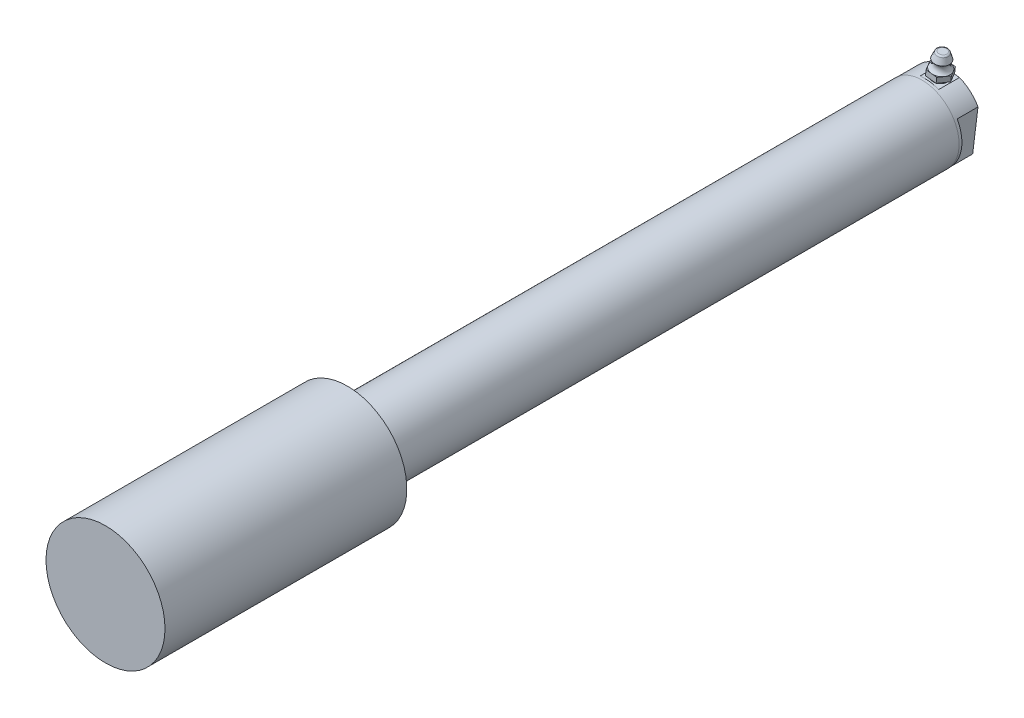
ISO-10303-21;
HEADER;
FILE_DESCRIPTION(('STEP AP214'),'2;1');
FILE_NAME('part.step','',(''),(''),'','','');
FILE_SCHEMA(('AUTOMOTIVE_DESIGN { 1 0 10303 214 1 1 1 1 }'));
ENDSEC;
DATA;
#1=APPLICATION_CONTEXT('core data for automotive mechanical design processes');
#2=APPLICATION_PROTOCOL_DEFINITION('international standard','automotive_design',2000,#1);
#3=PRODUCT_CONTEXT('',#1,'mechanical');
#4=PRODUCT('Part','Part','',(#3));
#5=PRODUCT_RELATED_PRODUCT_CATEGORY('part','',(#4));
#6=PRODUCT_DEFINITION_FORMATION('','',#4);
#7=PRODUCT_DEFINITION_CONTEXT('part definition',#1,'design');
#8=PRODUCT_DEFINITION('design','',#6,#7);
#9=PRODUCT_DEFINITION_SHAPE('','',#8);
#10=(LENGTH_UNIT() NAMED_UNIT(*) SI_UNIT(.MILLI.,.METRE.));
#11=(NAMED_UNIT(*) PLANE_ANGLE_UNIT() SI_UNIT($,.RADIAN.));
#12=(NAMED_UNIT(*) SI_UNIT($,.STERADIAN.) SOLID_ANGLE_UNIT());
#13=UNCERTAINTY_MEASURE_WITH_UNIT(LENGTH_MEASURE(1.E-05),#10,'distance_accuracy_value','');
#14=(GEOMETRIC_REPRESENTATION_CONTEXT(3) GLOBAL_UNCERTAINTY_ASSIGNED_CONTEXT((#13)) GLOBAL_UNIT_ASSIGNED_CONTEXT((#10,
#11,#12)) REPRESENTATION_CONTEXT('',''));
#15=CARTESIAN_POINT('',(0.,0.,0.));
#16=DIRECTION('',(0.,0.,1.));
#17=DIRECTION('',(1.,0.,0.));
#18=AXIS2_PLACEMENT_3D('',#15,#16,#17);
#19=CARTESIAN_POINT('',(1.40263997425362,11.4235858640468,4.445));
#20=DIRECTION('',(0.121869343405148,0.992546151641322,0.));
#21=DIRECTION('',(0.,0.,1.));
#22=AXIS2_PLACEMENT_3D('',#19,#20,#21);
#23=CONICAL_SURFACE('',#22,3.048,0.0447462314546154);
#24=CARTESIAN_POINT('',(1.92113309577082,15.6463734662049,4.445));
#25=DIRECTION('',(-0.121869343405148,-0.992546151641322,0.));
#26=DIRECTION('',(0.,0.,-1.));
#27=AXIS2_PLACEMENT_3D('',#24,#25,#26);
#28=CIRCLE('',#27,3.2385);
#29=CARTESIAN_POINT('',(1.92113309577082,15.6463734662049,1.2065));
#30=VERTEX_POINT('',#29);
#31=EDGE_CURVE('E363',#30,#30,#28,.T.);
#32=ORIENTED_EDGE('',*,*,#31,.T.);
#33=EDGE_LOOP('',(#32));
#34=FACE_BOUND('',#33,.T.);
#35=CARTESIAN_POINT('',(1.85728879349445,15.1264033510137,4.445));
#36=DIRECTION('',(-0.121869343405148,-0.992546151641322,0.));
#37=DIRECTION('',(0.992546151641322,-0.121869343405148,0.));
#38=AXIS2_PLACEMENT_3D('',#35,#36,#37);
#39=CIRCLE('',#38,3.21504291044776);
#40=CARTESIAN_POINT('',(5.04836726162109,14.7345881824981,4.445));
#41=VERTEX_POINT('',#40);
#42=EDGE_CURVE('E10',#41,#41,#39,.T.);
#43=ORIENTED_EDGE('',*,*,#42,.F.);
#44=EDGE_LOOP('',(#43));
#45=FACE_BOUND('',#44,.T.);
#46=ADVANCED_FACE('F16',(#34,#45),#23,.T.);
#47=CARTESIAN_POINT('',(-0.00103534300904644,18.7933338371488,0.47625));
#48=DIRECTION('',(0.121869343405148,0.992546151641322,0.));
#49=DIRECTION('',(0.992546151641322,-0.121869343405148,0.));
#50=AXIS2_PLACEMENT_3D('',#47,#48,#49);
#51=PLANE('',#50);
#52=CARTESIAN_POINT('',(2.27324409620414,18.5140874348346,4.445));
#53=DIRECTION('',(-0.121869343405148,-0.992546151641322,0.));
#54=DIRECTION('',(0.,0.,-1.));
#55=AXIS2_PLACEMENT_3D('',#52,#53,#54);
#56=CIRCLE('',#55,3.96875);
#57=CARTESIAN_POINT('',(2.27324409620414,18.5140874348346,8.41375));
#58=VERTEX_POINT('',#57);
#59=CARTESIAN_POINT('',(-1.13817506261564,18.932957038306,6.429375));
#60=VERTEX_POINT('',#59);
#61=EDGE_CURVE('E396',#58,#60,#56,.T.);
#62=ORIENTED_EDGE('',*,*,#61,.T.);
#63=DIRECTION('',(0.496273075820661,-0.0609346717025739,0.866025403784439));
#64=VECTOR('',#63,1.);
#65=CARTESIAN_POINT('',(-2.27531478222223,19.0725802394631,4.445));
#66=LINE('',#65,#64);
#67=CARTESIAN_POINT('',(-0.00103534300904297,18.7933338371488,8.41375));
#68=VERTEX_POINT('',#67);
#69=EDGE_CURVE('E376',#60,#68,#66,.T.);
#70=ORIENTED_EDGE('',*,*,#69,.T.);
#71=DIRECTION('',(0.992546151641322,-0.121869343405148,0.));
#72=VECTOR('',#71,1.);
#73=CARTESIAN_POINT('',(-0.00103534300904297,18.7933338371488,8.41375));
#74=LINE('',#73,#72);
#75=EDGE_CURVE('E370',#68,#58,#74,.T.);
#76=ORIENTED_EDGE('',*,*,#75,.T.);
#77=EDGE_LOOP('',(#62,#70,#76));
#78=FACE_BOUND('',#77,.T.);
#79=ADVANCED_FACE('F251',(#78),#51,.T.);
#80=CARTESIAN_POINT('',(5.68466325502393,18.0952178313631,6.429375));
#81=VERTEX_POINT('',#80);
#82=EDGE_CURVE('E400',#81,#58,#56,.T.);
#83=ORIENTED_EDGE('',*,*,#82,.T.);
#84=CARTESIAN_POINT('',(4.54752353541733,18.2348410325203,8.41375));
#85=VERTEX_POINT('',#84);
#86=EDGE_CURVE('E373',#58,#85,#74,.T.);
#87=ORIENTED_EDGE('',*,*,#86,.T.);
#88=DIRECTION('',(0.496273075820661,-0.0609346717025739,-0.866025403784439));
#89=VECTOR('',#88,1.);
#90=CARTESIAN_POINT('',(4.54752353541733,18.2348410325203,8.41375));
#91=LINE('',#90,#89);
#92=EDGE_CURVE('E366',#85,#81,#91,.T.);
#93=ORIENTED_EDGE('',*,*,#92,.T.);
#94=EDGE_LOOP('',(#83,#87,#93));
#95=FACE_BOUND('',#94,.T.);
#96=ADVANCED_FACE('F406',(#95),#51,.T.);
#97=CARTESIAN_POINT('',(5.68466325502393,18.0952178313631,2.460625));
#98=VERTEX_POINT('',#97);
#99=EDGE_CURVE('E94',#98,#81,#56,.T.);
#100=ORIENTED_EDGE('',*,*,#99,.T.);
#101=CARTESIAN_POINT('',(6.82180297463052,17.9555946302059,4.445));
#102=VERTEX_POINT('',#101);
#103=EDGE_CURVE('E369',#81,#102,#91,.T.);
#104=ORIENTED_EDGE('',*,*,#103,.T.);
#105=DIRECTION('',(-0.496273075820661,0.0609346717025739,-0.866025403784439));
#106=VECTOR('',#105,1.);
#107=CARTESIAN_POINT('',(6.82180297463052,17.9555946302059,4.445));
#108=LINE('',#107,#106);
#109=EDGE_CURVE('E348',#102,#98,#108,.T.);
#110=ORIENTED_EDGE('',*,*,#109,.T.);
#111=EDGE_LOOP('',(#100,#104,#110));
#112=FACE_BOUND('',#111,.T.);
#113=ADVANCED_FACE('F423',(#112),#51,.T.);
#114=CARTESIAN_POINT('',(2.27324409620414,18.5140874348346,0.47625));
#115=VERTEX_POINT('',#114);
#116=EDGE_CURVE('E101',#115,#98,#56,.T.);
#117=ORIENTED_EDGE('',*,*,#116,.T.);
#118=CARTESIAN_POINT('',(4.54752353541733,18.2348410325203,0.47625));
#119=VERTEX_POINT('',#118);
#120=EDGE_CURVE('E365',#98,#119,#108,.T.);
#121=ORIENTED_EDGE('',*,*,#120,.T.);
#122=DIRECTION('',(-0.992546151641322,0.121869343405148,0.));
#123=VECTOR('',#122,1.);
#124=CARTESIAN_POINT('',(4.54752353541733,18.2348410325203,0.47625));
#125=LINE('',#124,#123);
#126=EDGE_CURVE('E381',#119,#115,#125,.T.);
#127=ORIENTED_EDGE('',*,*,#126,.T.);
#128=EDGE_LOOP('',(#117,#121,#127));
#129=FACE_BOUND('',#128,.T.);
#130=ADVANCED_FACE('F425',(#129),#51,.T.);
#131=CARTESIAN_POINT('',(-1.13817506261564,18.932957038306,2.460625));
#132=VERTEX_POINT('',#131);
#133=EDGE_CURVE('E389',#132,#115,#56,.T.);
#134=ORIENTED_EDGE('',*,*,#133,.T.);
#135=CARTESIAN_POINT('',(-0.00103534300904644,18.7933338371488,0.47625));
#136=VERTEX_POINT('',#135);
#137=EDGE_CURVE('E351',#115,#136,#125,.T.);
#138=ORIENTED_EDGE('',*,*,#137,.T.);
#139=DIRECTION('',(-0.496273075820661,0.0609346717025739,0.866025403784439));
#140=VECTOR('',#139,1.);
#141=CARTESIAN_POINT('',(-0.00103534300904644,18.7933338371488,0.47625));
#142=LINE('',#141,#140);
#143=EDGE_CURVE('E377',#136,#132,#142,.T.);
#144=ORIENTED_EDGE('',*,*,#143,.T.);
#145=EDGE_LOOP('',(#134,#138,#144));
#146=FACE_BOUND('',#145,.T.);
#147=ADVANCED_FACE('F264',(#146),#51,.T.);
#148=CARTESIAN_POINT('',(4.54752353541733,18.2348410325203,0.47625));
#149=DIRECTION('',(0.,0.,1.));
#150=DIRECTION('',(-0.121869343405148,-0.992546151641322,0.));
#151=AXIS2_PLACEMENT_3D('',#148,#149,#150);
#152=PLANE('',#151);
#153=DIRECTION('',(-0.992546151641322,0.121869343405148,0.));
#154=VECTOR('',#153,1.);
#155=CARTESIAN_POINT('',(4.25732216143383,15.8713405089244,0.47625));
#156=LINE('',#155,#154);
#157=CARTESIAN_POINT('',(4.25732216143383,15.8713405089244,0.47625));
#158=VERTEX_POINT('',#157);
#159=CARTESIAN_POINT('',(-0.291236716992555,16.4298333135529,0.47625));
#160=VERTEX_POINT('',#159);
#161=EDGE_CURVE('E360',#158,#160,#156,.T.);
#162=ORIENTED_EDGE('',*,*,#161,.T.);
#163=DIRECTION('',(-0.121869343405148,-0.992546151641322,0.));
#164=VECTOR('',#163,1.);
#165=CARTESIAN_POINT('',(-0.00103534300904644,18.7933338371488,0.47625));
#166=LINE('',#165,#164);
#167=EDGE_CURVE('E330',#136,#160,#166,.T.);
#168=ORIENTED_EDGE('',*,*,#167,.F.);
#169=ORIENTED_EDGE('',*,*,#137,.F.);
#170=ORIENTED_EDGE('',*,*,#126,.F.);
#171=DIRECTION('',(-0.121869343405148,-0.992546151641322,0.));
#172=VECTOR('',#171,1.);
#173=CARTESIAN_POINT('',(4.54752353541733,18.2348410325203,0.47625));
#174=LINE('',#173,#172);
#175=EDGE_CURVE('E345',#119,#158,#174,.T.);
#176=ORIENTED_EDGE('',*,*,#175,.T.);
#177=EDGE_LOOP('',(#162,#168,#169,#170,#176));
#178=FACE_BOUND('',#177,.T.);
#179=ADVANCED_FACE('F286',(#178),#152,.F.);
#180=CARTESIAN_POINT('',(-0.00103534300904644,18.7933338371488,0.47625));
#181=DIRECTION('',(0.859570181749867,-0.105541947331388,0.5));
#182=DIRECTION('',(0.496273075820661,-0.0609346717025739,-0.866025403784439));
#183=AXIS2_PLACEMENT_3D('',#180,#181,#182);
#184=PLANE('',#183);
#185=DIRECTION('',(-0.496273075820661,0.0609346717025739,0.866025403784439));
#186=VECTOR('',#185,1.);
#187=CARTESIAN_POINT('',(-0.291236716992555,16.4298333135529,0.47625));
#188=LINE('',#187,#186);
#189=CARTESIAN_POINT('',(-2.56551615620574,16.7090797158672,4.445));
#190=VERTEX_POINT('',#189);
#191=EDGE_CURVE('E358',#160,#190,#188,.T.);
#192=ORIENTED_EDGE('',*,*,#191,.T.);
#193=DIRECTION('',(-0.121869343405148,-0.992546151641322,0.));
#194=VECTOR('',#193,1.);
#195=CARTESIAN_POINT('',(-2.27531478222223,19.0725802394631,4.445));
#196=LINE('',#195,#194);
#197=CARTESIAN_POINT('',(-2.27531478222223,19.0725802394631,4.445));
#198=VERTEX_POINT('',#197);
#199=EDGE_CURVE('E333',#198,#190,#196,.T.);
#200=ORIENTED_EDGE('',*,*,#199,.F.);
#201=EDGE_CURVE('E380',#132,#198,#142,.T.);
#202=ORIENTED_EDGE('',*,*,#201,.F.);
#203=ORIENTED_EDGE('',*,*,#143,.F.);
#204=ORIENTED_EDGE('',*,*,#167,.T.);
#205=EDGE_LOOP('',(#192,#200,#202,#203,#204));
#206=FACE_BOUND('',#205,.T.);
#207=ADVANCED_FACE('F282',(#206),#184,.F.);
#208=CARTESIAN_POINT('',(-2.27531478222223,19.0725802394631,4.445));
#209=DIRECTION('',(0.859570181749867,-0.105541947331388,-0.5));
#210=DIRECTION('',(-0.496273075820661,0.0609346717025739,-0.866025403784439));
#211=AXIS2_PLACEMENT_3D('',#208,#209,#210);
#212=PLANE('',#211);
#213=DIRECTION('',(0.496273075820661,-0.0609346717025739,0.866025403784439));
#214=VECTOR('',#213,1.);
#215=CARTESIAN_POINT('',(-2.56551615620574,16.7090797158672,4.445));
#216=LINE('',#215,#214);
#217=CARTESIAN_POINT('',(-0.291236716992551,16.4298333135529,8.41375));
#218=VERTEX_POINT('',#217);
#219=EDGE_CURVE('E356',#190,#218,#216,.T.);
#220=ORIENTED_EDGE('',*,*,#219,.T.);
#221=DIRECTION('',(-0.121869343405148,-0.992546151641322,0.));
#222=VECTOR('',#221,1.);
#223=CARTESIAN_POINT('',(-0.00103534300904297,18.7933338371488,8.41375));
#224=LINE('',#223,#222);
#225=EDGE_CURVE('E336',#68,#218,#224,.T.);
#226=ORIENTED_EDGE('',*,*,#225,.F.);
#227=ORIENTED_EDGE('',*,*,#69,.F.);
#228=EDGE_CURVE('E374',#198,#60,#66,.T.);
#229=ORIENTED_EDGE('',*,*,#228,.F.);
#230=ORIENTED_EDGE('',*,*,#199,.T.);
#231=EDGE_LOOP('',(#220,#226,#227,#229,#230));
#232=FACE_BOUND('',#231,.T.);
#233=ADVANCED_FACE('F278',(#232),#212,.F.);
#234=CARTESIAN_POINT('',(-0.00103534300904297,18.7933338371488,8.41375));
#235=DIRECTION('',(0.,0.,-1.));
#236=DIRECTION('',(-0.992546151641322,0.121869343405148,0.));
#237=AXIS2_PLACEMENT_3D('',#234,#235,#236);
#238=PLANE('',#237);
#239=DIRECTION('',(0.992546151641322,-0.121869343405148,0.));
#240=VECTOR('',#239,1.);
#241=CARTESIAN_POINT('',(-0.291236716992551,16.4298333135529,8.41375));
#242=LINE('',#241,#240);
#243=CARTESIAN_POINT('',(4.25732216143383,15.8713405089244,8.41375));
#244=VERTEX_POINT('',#243);
#245=EDGE_CURVE('E354',#218,#244,#242,.T.);
#246=ORIENTED_EDGE('',*,*,#245,.T.);
#247=DIRECTION('',(-0.121869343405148,-0.992546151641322,0.));
#248=VECTOR('',#247,1.);
#249=CARTESIAN_POINT('',(4.54752353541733,18.2348410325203,8.41375));
#250=LINE('',#249,#248);
#251=EDGE_CURVE('E339',#85,#244,#250,.T.);
#252=ORIENTED_EDGE('',*,*,#251,.F.);
#253=ORIENTED_EDGE('',*,*,#86,.F.);
#254=ORIENTED_EDGE('',*,*,#75,.F.);
#255=ORIENTED_EDGE('',*,*,#225,.T.);
#256=EDGE_LOOP('',(#246,#252,#253,#254,#255));
#257=FACE_BOUND('',#256,.T.);
#258=ADVANCED_FACE('F274',(#257),#238,.F.);
#259=CARTESIAN_POINT('',(4.54752353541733,18.2348410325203,8.41375));
#260=DIRECTION('',(-0.859570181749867,0.105541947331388,-0.5));
#261=DIRECTION('',(-0.496273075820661,0.0609346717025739,0.866025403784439));
#262=AXIS2_PLACEMENT_3D('',#259,#260,#261);
#263=PLANE('',#262);
#264=DIRECTION('',(0.496273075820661,-0.0609346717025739,-0.866025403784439));
#265=VECTOR('',#264,1.);
#266=CARTESIAN_POINT('',(4.25732216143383,15.8713405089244,8.41375));
#267=LINE('',#266,#265);
#268=CARTESIAN_POINT('',(6.53160160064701,15.5920941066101,4.445));
#269=VERTEX_POINT('',#268);
#270=EDGE_CURVE('E352',#244,#269,#267,.T.);
#271=ORIENTED_EDGE('',*,*,#270,.T.);
#272=DIRECTION('',(-0.121869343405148,-0.992546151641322,0.));
#273=VECTOR('',#272,1.);
#274=CARTESIAN_POINT('',(6.82180297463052,17.9555946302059,4.445));
#275=LINE('',#274,#273);
#276=EDGE_CURVE('E342',#102,#269,#275,.T.);
#277=ORIENTED_EDGE('',*,*,#276,.F.);
#278=ORIENTED_EDGE('',*,*,#103,.F.);
#279=ORIENTED_EDGE('',*,*,#92,.F.);
#280=ORIENTED_EDGE('',*,*,#251,.T.);
#281=EDGE_LOOP('',(#271,#277,#278,#279,#280));
#282=FACE_BOUND('',#281,.T.);
#283=ADVANCED_FACE('F270',(#282),#263,.F.);
#284=CARTESIAN_POINT('',(6.82180297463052,17.9555946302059,4.445));
#285=DIRECTION('',(-0.859570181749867,0.105541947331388,0.5));
#286=DIRECTION('',(0.496273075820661,-0.0609346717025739,0.866025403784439));
#287=AXIS2_PLACEMENT_3D('',#284,#285,#286);
#288=PLANE('',#287);
#289=DIRECTION('',(-0.496273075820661,0.0609346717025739,-0.866025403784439));
#290=VECTOR('',#289,1.);
#291=CARTESIAN_POINT('',(6.53160160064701,15.5920941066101,4.445));
#292=LINE('',#291,#290);
#293=EDGE_CURVE('E349',#269,#158,#292,.T.);
#294=ORIENTED_EDGE('',*,*,#293,.T.);
#295=ORIENTED_EDGE('',*,*,#175,.F.);
#296=ORIENTED_EDGE('',*,*,#120,.F.);
#297=ORIENTED_EDGE('',*,*,#109,.F.);
#298=ORIENTED_EDGE('',*,*,#276,.T.);
#299=EDGE_LOOP('',(#294,#295,#296,#297,#298));
#300=FACE_BOUND('',#299,.T.);
#301=ADVANCED_FACE('F262',(#300),#288,.F.);
#302=EDGE_CURVE('E392',#60,#132,#56,.T.);
#303=ORIENTED_EDGE('',*,*,#302,.T.);
#304=ORIENTED_EDGE('',*,*,#201,.T.);
#305=ORIENTED_EDGE('',*,*,#228,.T.);
#306=EDGE_LOOP('',(#303,#304,#305));
#307=FACE_BOUND('',#306,.T.);
#308=ADVANCED_FACE('F259',(#307),#51,.T.);
#309=CARTESIAN_POINT('',(-0.291236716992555,16.4298333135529,0.47625));
#310=DIRECTION('',(0.121869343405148,0.992546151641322,0.));
#311=DIRECTION('',(0.992546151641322,-0.121869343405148,0.));
#312=AXIS2_PLACEMENT_3D('',#309,#310,#311);
#313=PLANE('',#312);
#314=CARTESIAN_POINT('',(1.98304272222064,16.1505869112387,4.445));
#315=DIRECTION('',(-0.121869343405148,-0.992546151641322,0.));
#316=DIRECTION('',(0.,0.,-1.));
#317=AXIS2_PLACEMENT_3D('',#314,#315,#316);
#318=CIRCLE('',#317,3.2385);
#319=CARTESIAN_POINT('',(1.98304272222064,16.1505869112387,1.2065));
#320=VERTEX_POINT('',#319);
#321=EDGE_CURVE('E385',#320,#320,#318,.T.);
#322=ORIENTED_EDGE('',*,*,#321,.F.);
#323=EDGE_LOOP('',(#322));
#324=FACE_BOUND('',#323,.T.);
#325=ORIENTED_EDGE('',*,*,#161,.F.);
#326=ORIENTED_EDGE('',*,*,#293,.F.);
#327=ORIENTED_EDGE('',*,*,#270,.F.);
#328=ORIENTED_EDGE('',*,*,#245,.F.);
#329=ORIENTED_EDGE('',*,*,#219,.F.);
#330=ORIENTED_EDGE('',*,*,#191,.F.);
#331=EDGE_LOOP('',(#325,#326,#327,#328,#329,#330));
#332=FACE_BOUND('',#331,.T.);
#333=ADVANCED_FACE('F247',(#324,#332),#313,.F.);
#334=CARTESIAN_POINT('',(1.98304272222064,16.1505869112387,4.445));
#335=DIRECTION('',(-0.121869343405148,-0.992546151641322,0.));
#336=DIRECTION('',(0.,0.,-1.));
#337=AXIS2_PLACEMENT_3D('',#334,#335,#336);
#338=CYLINDRICAL_SURFACE('',#337,3.2385);
#339=ORIENTED_EDGE('',*,*,#321,.T.);
#340=EDGE_LOOP('',(#339));
#341=FACE_BOUND('',#340,.T.);
#342=ORIENTED_EDGE('',*,*,#31,.F.);
#343=EDGE_LOOP('',(#342));
#344=FACE_BOUND('',#343,.T.);
#345=ADVANCED_FACE('F243',(#341,#344),#338,.T.);
#346=CARTESIAN_POINT('',(2.72402356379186,22.1853915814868,4.445));
#347=DIRECTION('',(-0.121869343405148,-0.992546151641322,0.));
#348=DIRECTION('',(0.,0.,-1.));
#349=AXIS2_PLACEMENT_3D('',#346,#347,#348);
#350=CONICAL_SURFACE('',#349,3.3655,0.340381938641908);
#351=CARTESIAN_POINT('',(3.03361941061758,24.7068474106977,4.445));
#352=DIRECTION('',(0.121869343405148,0.992546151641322,0.));
#353=DIRECTION('',(0.,0.,1.));
#354=AXIS2_PLACEMENT_3D('',#351,#352,#353);
#355=CIRCLE('',#354,2.46577800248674);
#356=CARTESIAN_POINT('',(3.03361941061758,24.7068474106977,6.91077800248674));
#357=VERTEX_POINT('',#356);
#358=EDGE_CURVE('E327',#357,#357,#355,.F.);
#359=ORIENTED_EDGE('',*,*,#358,.T.);
#360=EDGE_LOOP('',(#359));
#361=FACE_BOUND('',#360,.T.);
#362=CARTESIAN_POINT('',(2.72402356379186,22.1853915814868,4.445));
#363=DIRECTION('',(-0.121869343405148,-0.992546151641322,0.));
#364=DIRECTION('',(0.,0.,-1.));
#365=AXIS2_PLACEMENT_3D('',#362,#363,#364);
#366=CIRCLE('',#365,3.3655);
#367=CARTESIAN_POINT('',(2.72402356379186,22.1853915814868,1.0795));
#368=VERTEX_POINT('',#367);
#369=EDGE_CURVE('E318',#368,#368,#366,.T.);
#370=ORIENTED_EDGE('',*,*,#369,.F.);
#371=EDGE_LOOP('',(#370));
#372=FACE_BOUND('',#371,.T.);
#373=ADVANCED_FACE('F246',(#361,#372),#350,.T.);
#374=CARTESIAN_POINT('',(3.09548132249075,25.2106722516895,4.445));
#375=DIRECTION('',(0.121869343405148,0.992546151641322,0.));
#376=DIRECTION('',(0.,0.,1.));
#377=AXIS2_PLACEMENT_3D('',#374,#375,#376);
#378=PLANE('',#377);
#379=CARTESIAN_POINT('',(3.09548132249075,25.2106722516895,4.445));
#380=DIRECTION('',(0.121869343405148,0.992546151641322,0.));
#381=DIRECTION('',(0.,0.,1.));
#382=AXIS2_PLACEMENT_3D('',#379,#380,#381);
#383=CIRCLE('',#382,1.7474960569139);
#384=CARTESIAN_POINT('',(3.09548132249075,25.2106722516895,6.1924960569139));
#385=VERTEX_POINT('',#384);
#386=EDGE_CURVE('E199',#385,#385,#383,.T.);
#387=ORIENTED_EDGE('',*,*,#386,.T.);
#388=EDGE_LOOP('',(#387));
#389=FACE_BOUND('',#388,.T.);
#390=ADVANCED_FACE('F241',(#389),#378,.T.);
#391=CARTESIAN_POINT('',(2.52923860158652,20.5989953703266,4.445));
#392=DIRECTION('',(-0.121869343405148,-0.992546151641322,0.));
#393=DIRECTION('',(0.,0.,-1.));
#394=AXIS2_PLACEMENT_3D('',#391,#392,#393);
#395=TOROIDAL_SURFACE('',#394,5.20693450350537,2.43833450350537);
#396=ORIENTED_EDGE('',*,*,#369,.T.);
#397=EDGE_LOOP('',(#396));
#398=FACE_BOUND('',#397,.T.);
#399=ORIENTED_EDGE('',*,*,#116,.F.);
#400=ORIENTED_EDGE('',*,*,#133,.F.);
#401=ORIENTED_EDGE('',*,*,#302,.F.);
#402=ORIENTED_EDGE('',*,*,#61,.F.);
#403=ORIENTED_EDGE('',*,*,#82,.F.);
#404=ORIENTED_EDGE('',*,*,#99,.F.);
#405=EDGE_LOOP('',(#399,#400,#401,#402,#403,#404));
#406=FACE_BOUND('',#405,.T.);
#407=ADVANCED_FACE('F230',(#398,#406),#395,.F.);
#408=CARTESIAN_POINT('',(3.00261688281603,24.4543520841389,4.445));
#409=DIRECTION('',(0.121869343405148,0.992546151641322,0.));
#410=DIRECTION('',(0.,0.,1.));
#411=AXIS2_PLACEMENT_3D('',#408,#409,#410);
#412=TOROIDAL_SURFACE('',#411,1.7474960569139,0.762);
#413=ORIENTED_EDGE('',*,*,#386,.F.);
#414=EDGE_LOOP('',(#413));
#415=FACE_BOUND('',#414,.T.);
#416=ORIENTED_EDGE('',*,*,#358,.F.);
#417=EDGE_LOOP('',(#416));
#418=FACE_BOUND('',#417,.T.);
#419=ADVANCED_FACE('F223',(#415,#418),#412,.T.);
#420=CARTESIAN_POINT('',(0.,0.,32.512));
#421=DIRECTION('',(0.,0.,-1.));
#422=DIRECTION('',(0.121869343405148,0.992546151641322,0.));
#423=AXIS2_PLACEMENT_3D('',#420,#421,#422);
#424=CONICAL_SURFACE('',#423,4.96062,1.02974425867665);
#425=CARTESIAN_POINT('',(0.,0.,35.4926412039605));
#426=VERTEX_POINT('',#425);
#427=VERTEX_LOOP('',#426);
#428=FACE_BOUND('',#427,.T.);
#429=CARTESIAN_POINT('',(0.,0.,32.512));
#430=DIRECTION('',(0.,0.,-1.));
#431=DIRECTION('',(0.121869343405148,0.992546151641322,0.));
#432=AXIS2_PLACEMENT_3D('',#429,#430,#431);
#433=CIRCLE('',#432,4.96062);
#434=CARTESIAN_POINT('',(0.604547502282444,4.92364429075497,32.512));
#435=VERTEX_POINT('',#434);
#436=EDGE_CURVE('E174',#435,#435,#433,.T.);
#437=ORIENTED_EDGE('',*,*,#436,.T.);
#438=EDGE_LOOP('',(#437));
#439=FACE_BOUND('',#438,.T.);
#440=ADVANCED_FACE('F218',(#428,#439),#424,.F.);
#441=CARTESIAN_POINT('',(0.,0.,0.));
#442=DIRECTION('',(0.,0.,-1.));
#443=DIRECTION('',(0.121869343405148,0.992546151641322,0.));
#444=AXIS2_PLACEMENT_3D('',#441,#442,#443);
#445=CYLINDRICAL_SURFACE('',#444,4.96062);
#446=ORIENTED_EDGE('',*,*,#436,.F.);
#447=EDGE_LOOP('',(#446));
#448=FACE_BOUND('',#447,.T.);
#449=CARTESIAN_POINT('',(0.,0.,0.));
#450=DIRECTION('',(0.,0.,-1.));
#451=DIRECTION('',(0.121869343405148,0.992546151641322,0.));
#452=AXIS2_PLACEMENT_3D('',#449,#450,#451);
#453=CIRCLE('',#452,4.96062);
#454=CARTESIAN_POINT('',(0.604547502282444,4.92364429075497,0.));
#455=VERTEX_POINT('',#454);
#456=EDGE_CURVE('E172',#455,#455,#453,.T.);
#457=ORIENTED_EDGE('',*,*,#456,.T.);
#458=EDGE_LOOP('',(#457));
#459=FACE_BOUND('',#458,.T.);
#460=ADVANCED_FACE('F208',(#448,#459),#445,.F.);
#461=CARTESIAN_POINT('',(0.,0.,8.89));
#462=DIRECTION('',(0.,0.,-1.));
#463=DIRECTION('',(0.121869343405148,0.992546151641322,0.));
#464=AXIS2_PLACEMENT_3D('',#461,#462,#463);
#465=PLANE('',#464);
#466=CARTESIAN_POINT('',(0.,0.,8.89));
#467=DIRECTION('',(0.,0.,-1.));
#468=DIRECTION('',(0.121869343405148,0.992546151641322,0.));
#469=AXIS2_PLACEMENT_3D('',#466,#467,#468);
#470=CIRCLE('',#469,15.7607);
#471=CARTESIAN_POINT('',(13.7427738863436,7.71594650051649,8.89));
#472=VERTEX_POINT('',#471);
#473=CARTESIAN_POINT('',(11.467898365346,-10.8114278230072,8.89));
#474=VERTEX_POINT('',#473);
#475=EDGE_CURVE('E158',#472,#474,#470,.T.);
#476=ORIENTED_EDGE('',*,*,#475,.T.);
#477=DIRECTION('',(0.121869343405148,0.992546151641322,0.));
#478=VECTOR('',#477,1.);
#479=CARTESIAN_POINT('',(11.467898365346,-10.8114278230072,8.89));
#480=LINE('',#479,#478);
#481=EDGE_CURVE('E144',#474,#472,#480,.T.);
#482=ORIENTED_EDGE('',*,*,#481,.T.);
#483=EDGE_LOOP('',(#476,#482));
#484=FACE_BOUND('',#483,.T.);
#485=ADVANCED_FACE('F206',(#484),#465,.T.);
#486=CARTESIAN_POINT('',(11.467898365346,-10.8114278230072,8.89));
#487=DIRECTION('',(-0.992546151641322,0.121869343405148,0.));
#488=DIRECTION('',(0.,0.,1.));
#489=AXIS2_PLACEMENT_3D('',#486,#487,#488);
#490=PLANE('',#489);
#491=DIRECTION('',(0.121869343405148,0.992546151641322,0.));
#492=VECTOR('',#491,1.);
#493=CARTESIAN_POINT('',(11.467898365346,-10.8114278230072,0.));
#494=LINE('',#493,#492);
#495=CARTESIAN_POINT('',(11.467898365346,-10.8114278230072,0.));
#496=VERTEX_POINT('',#495);
#497=CARTESIAN_POINT('',(13.7427738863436,7.71594650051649,0.));
#498=VERTEX_POINT('',#497);
#499=EDGE_CURVE('E141',#496,#498,#494,.T.);
#500=ORIENTED_EDGE('',*,*,#499,.T.);
#501=DIRECTION('',(0.,0.,-1.));
#502=VECTOR('',#501,1.);
#503=CARTESIAN_POINT('',(13.7427738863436,7.71594650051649,8.89));
#504=LINE('',#503,#502);
#505=EDGE_CURVE('E148',#472,#498,#504,.T.);
#506=ORIENTED_EDGE('',*,*,#505,.F.);
#507=ORIENTED_EDGE('',*,*,#481,.F.);
#508=DIRECTION('',(0.,0.,-1.));
#509=VECTOR('',#508,1.);
#510=CARTESIAN_POINT('',(11.467898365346,-10.8114278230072,8.89));
#511=LINE('',#510,#509);
#512=EDGE_CURVE('E138',#474,#496,#511,.T.);
#513=ORIENTED_EDGE('',*,*,#512,.T.);
#514=EDGE_LOOP('',(#500,#506,#507,#513));
#515=FACE_BOUND('',#514,.T.);
#516=ADVANCED_FACE('F140',(#515),#490,.F.);
#517=CARTESIAN_POINT('',(0.,0.,8.89));
#518=DIRECTION('',(0.,0.,-1.));
#519=DIRECTION('',(0.121869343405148,0.992546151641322,0.));
#520=AXIS2_PLACEMENT_3D('',#517,#518,#519);
#521=PLANE('',#520);
#522=CARTESIAN_POINT('',(0.,0.,8.89));
#523=DIRECTION('',(0.,0.,-1.));
#524=DIRECTION('',(0.121869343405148,0.992546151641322,0.));
#525=AXIS2_PLACEMENT_3D('',#522,#523,#524);
#526=CIRCLE('',#525,15.7607);
#527=CARTESIAN_POINT('',(-13.7427738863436,-7.71594650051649,8.89));
#528=VERTEX_POINT('',#527);
#529=CARTESIAN_POINT('',(-11.467898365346,10.8114278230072,8.89));
#530=VERTEX_POINT('',#529);
#531=EDGE_CURVE('E190',#528,#530,#526,.T.);
#532=ORIENTED_EDGE('',*,*,#531,.T.);
#533=DIRECTION('',(-0.121869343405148,-0.992546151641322,0.));
#534=VECTOR('',#533,1.);
#535=CARTESIAN_POINT('',(-13.7427738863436,-7.71594650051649,8.89));
#536=LINE('',#535,#534);
#537=EDGE_CURVE('E186',#530,#528,#536,.T.);
#538=ORIENTED_EDGE('',*,*,#537,.T.);
#539=EDGE_LOOP('',(#532,#538));
#540=FACE_BOUND('',#539,.T.);
#541=ADVANCED_FACE('F216',(#540),#521,.T.);
#542=CARTESIAN_POINT('',(-13.7427738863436,-7.71594650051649,8.89));
#543=DIRECTION('',(0.992546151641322,-0.121869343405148,0.));
#544=DIRECTION('',(0.,0.,-1.));
#545=AXIS2_PLACEMENT_3D('',#542,#543,#544);
#546=PLANE('',#545);
#547=DIRECTION('',(-0.121869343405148,-0.992546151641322,0.));
#548=VECTOR('',#547,1.);
#549=CARTESIAN_POINT('',(-13.7427738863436,-7.71594650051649,0.));
#550=LINE('',#549,#548);
#551=CARTESIAN_POINT('',(-11.467898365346,10.8114278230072,0.));
#552=VERTEX_POINT('',#551);
#553=CARTESIAN_POINT('',(-13.7427738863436,-7.71594650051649,0.));
#554=VERTEX_POINT('',#553);
#555=EDGE_CURVE('E188',#552,#554,#550,.T.);
#556=ORIENTED_EDGE('',*,*,#555,.T.);
#557=DIRECTION('',(0.,0.,-1.));
#558=VECTOR('',#557,1.);
#559=CARTESIAN_POINT('',(-13.7427738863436,-7.71594650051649,8.89));
#560=LINE('',#559,#558);
#561=EDGE_CURVE('E159',#528,#554,#560,.T.);
#562=ORIENTED_EDGE('',*,*,#561,.F.);
#563=ORIENTED_EDGE('',*,*,#537,.F.);
#564=DIRECTION('',(0.,0.,-1.));
#565=VECTOR('',#564,1.);
#566=CARTESIAN_POINT('',(-11.467898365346,10.8114278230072,8.89));
#567=LINE('',#566,#565);
#568=EDGE_CURVE('E184',#530,#552,#567,.T.);
#569=ORIENTED_EDGE('',*,*,#568,.T.);
#570=EDGE_LOOP('',(#556,#562,#563,#569));
#571=FACE_BOUND('',#570,.T.);
#572=ADVANCED_FACE('F641',(#571),#546,.F.);
#573=CARTESIAN_POINT('',(-2.13048255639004,15.6160401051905,8.89));
#574=DIRECTION('',(0.,0.,-1.));
#575=DIRECTION('',(0.121869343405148,0.992546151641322,0.));
#576=AXIS2_PLACEMENT_3D('',#573,#574,#575);
#577=PLANE('',#576);
#578=CARTESIAN_POINT('',(0.,0.,8.89));
#579=DIRECTION('',(0.,0.,-1.));
#580=DIRECTION('',(0.121869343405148,0.992546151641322,0.));
#581=AXIS2_PLACEMENT_3D('',#578,#579,#580);
#582=CIRCLE('',#581,15.7607);
#583=CARTESIAN_POINT('',(5.84506014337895,14.636766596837,8.89));
#584=VERTEX_POINT('',#583);
#585=CARTESIAN_POINT('',(-2.13048255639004,15.6160401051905,8.89));
#586=VERTEX_POINT('',#585);
#587=EDGE_CURVE('E26',#584,#586,#582,.F.);
#588=ORIENTED_EDGE('',*,*,#587,.F.);
#589=DIRECTION('',(-0.992546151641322,0.121869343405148,0.));
#590=VECTOR('',#589,1.);
#591=CARTESIAN_POINT('',(5.84506014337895,14.636766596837,8.89));
#592=LINE('',#591,#590);
#593=EDGE_CURVE('E196',#584,#586,#592,.T.);
#594=ORIENTED_EDGE('',*,*,#593,.T.);
#595=EDGE_LOOP('',(#588,#594));
#596=FACE_BOUND('',#595,.T.);
#597=ADVANCED_FACE('F203',(#596),#577,.T.);
#598=CARTESIAN_POINT('',(0.,0.,10.16));
#599=DIRECTION('',(0.,0.,-1.));
#600=DIRECTION('',(0.121869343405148,0.992546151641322,0.));
#601=AXIS2_PLACEMENT_3D('',#598,#599,#600);
#602=CYLINDRICAL_SURFACE('',#601,15.7607);
#603=DIRECTION('',(0.,0.,-1.));
#604=VECTOR('',#603,1.);
#605=CARTESIAN_POINT('',(5.84506014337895,14.636766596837,8.89));
#606=LINE('',#605,#604);
#607=CARTESIAN_POINT('',(5.84506014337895,14.636766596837,0.));
#608=VERTEX_POINT('',#607);
#609=EDGE_CURVE('E35',#584,#608,#606,.T.);
#610=ORIENTED_EDGE('',*,*,#609,.F.);
#611=ORIENTED_EDGE('',*,*,#587,.T.);
#612=DIRECTION('',(0.,0.,-1.));
#613=VECTOR('',#612,1.);
#614=CARTESIAN_POINT('',(-2.13048255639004,15.6160401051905,8.89));
#615=LINE('',#614,#613);
#616=CARTESIAN_POINT('',(-2.13048255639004,15.6160401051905,0.));
#617=VERTEX_POINT('',#616);
#618=EDGE_CURVE('E194',#586,#617,#615,.T.);
#619=ORIENTED_EDGE('',*,*,#618,.T.);
#620=CARTESIAN_POINT('',(0.,0.,0.));
#621=DIRECTION('',(0.,0.,-1.));
#622=DIRECTION('',(0.121869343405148,0.992546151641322,0.));
#623=AXIS2_PLACEMENT_3D('',#620,#621,#622);
#624=CIRCLE('',#623,15.7607);
#625=EDGE_CURVE('E166',#552,#617,#624,.T.);
#626=ORIENTED_EDGE('',*,*,#625,.F.);
#627=ORIENTED_EDGE('',*,*,#568,.F.);
#628=ORIENTED_EDGE('',*,*,#531,.F.);
#629=ORIENTED_EDGE('',*,*,#561,.T.);
#630=EDGE_CURVE('E155',#496,#554,#624,.T.);
#631=ORIENTED_EDGE('',*,*,#630,.F.);
#632=ORIENTED_EDGE('',*,*,#512,.F.);
#633=ORIENTED_EDGE('',*,*,#475,.F.);
#634=ORIENTED_EDGE('',*,*,#505,.T.);
#635=EDGE_CURVE('E157',#608,#498,#624,.T.);
#636=ORIENTED_EDGE('',*,*,#635,.F.);
#637=EDGE_LOOP('',(#610,#611,#619,#626,#627,#628,#629,#631,#632,#633,#634,#636));
#638=FACE_BOUND('',#637,.T.);
#639=CARTESIAN_POINT('',(0.,0.,10.16));
#640=DIRECTION('',(0.,0.,-1.));
#641=DIRECTION('',(0.121869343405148,0.992546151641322,0.));
#642=AXIS2_PLACEMENT_3D('',#639,#640,#641);
#643=CIRCLE('',#642,15.7607);
#644=CARTESIAN_POINT('',(1.92074616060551,15.6432221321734,10.16));
#645=VERTEX_POINT('',#644);
#646=EDGE_CURVE('E165',#645,#645,#643,.T.);
#647=ORIENTED_EDGE('',*,*,#646,.T.);
#648=EDGE_LOOP('',(#647));
#649=FACE_BOUND('',#648,.T.);
#650=ADVANCED_FACE('F162',(#638,#649),#602,.T.);
#651=CARTESIAN_POINT('',(0.,0.,0.));
#652=DIRECTION('',(0.,0.,-1.));
#653=DIRECTION('',(0.121869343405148,0.992546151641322,0.));
#654=AXIS2_PLACEMENT_3D('',#651,#652,#653);
#655=PLANE('',#654);
#656=DIRECTION('',(-0.992546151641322,0.121869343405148,0.));
#657=VECTOR('',#656,1.);
#658=CARTESIAN_POINT('',(5.84506014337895,14.636766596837,0.));
#659=LINE('',#658,#657);
#660=EDGE_CURVE('E106',#608,#617,#659,.T.);
#661=ORIENTED_EDGE('',*,*,#660,.F.);
#662=ORIENTED_EDGE('',*,*,#635,.T.);
#663=ORIENTED_EDGE('',*,*,#499,.F.);
#664=ORIENTED_EDGE('',*,*,#630,.T.);
#665=ORIENTED_EDGE('',*,*,#555,.F.);
#666=ORIENTED_EDGE('',*,*,#625,.T.);
#667=EDGE_LOOP('',(#661,#662,#663,#664,#665,#666));
#668=FACE_BOUND('',#667,.T.);
#669=ORIENTED_EDGE('',*,*,#456,.F.);
#670=EDGE_LOOP('',(#669));
#671=FACE_BOUND('',#670,.T.);
#672=ADVANCED_FACE('F152',(#668,#671),#655,.T.);
#673=CARTESIAN_POINT('',(5.84506014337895,14.636766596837,8.89));
#674=DIRECTION('',(-0.121869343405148,-0.992546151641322,0.));
#675=DIRECTION('',(0.,0.,-1.));
#676=AXIS2_PLACEMENT_3D('',#673,#674,#675);
#677=PLANE('',#676);
#678=ORIENTED_EDGE('',*,*,#42,.T.);
#679=EDGE_LOOP('',(#678));
#680=FACE_BOUND('',#679,.T.);
#681=ORIENTED_EDGE('',*,*,#660,.T.);
#682=ORIENTED_EDGE('',*,*,#618,.F.);
#683=ORIENTED_EDGE('',*,*,#593,.F.);
#684=ORIENTED_EDGE('',*,*,#609,.T.);
#685=EDGE_LOOP('',(#681,#682,#683,#684));
#686=FACE_BOUND('',#685,.T.);
#687=ADVANCED_FACE('F204',(#680,#686),#677,.F.);
#688=CARTESIAN_POINT('',(0.,0.,358.7496));
#689=DIRECTION('',(0.,0.,1.));
#690=DIRECTION('',(1.,0.,0.));
#691=AXIS2_PLACEMENT_3D('',#688,#689,#690);
#692=PLANE('',#691);
#693=CARTESIAN_POINT('',(0.,0.,358.7496));
#694=DIRECTION('',(0.,0.,1.));
#695=DIRECTION('',(1.,0.,0.));
#696=AXIS2_PLACEMENT_3D('',#693,#694,#695);
#697=CIRCLE('',#696,25.4);
#698=CARTESIAN_POINT('',(25.4,0.,358.7496));
#699=VERTEX_POINT('',#698);
#700=EDGE_CURVE('E316',#699,#699,#697,.T.);
#701=ORIENTED_EDGE('',*,*,#700,.T.);
#702=EDGE_LOOP('',(#701));
#703=FACE_BOUND('',#702,.T.);
#704=ADVANCED_FACE('F296',(#703),#692,.T.);
#705=CARTESIAN_POINT('',(0.,0.,358.7496));
#706=DIRECTION('',(0.,0.,-1.));
#707=DIRECTION('',(-1.,0.,0.));
#708=AXIS2_PLACEMENT_3D('',#705,#706,#707);
#709=CYLINDRICAL_SURFACE('',#708,25.4);
#710=ORIENTED_EDGE('',*,*,#700,.F.);
#711=EDGE_LOOP('',(#710));
#712=FACE_BOUND('',#711,.T.);
#713=CARTESIAN_POINT('',(0.,0.,255.4986));
#714=DIRECTION('',(0.,0.,-1.));
#715=DIRECTION('',(-1.,0.,0.));
#716=AXIS2_PLACEMENT_3D('',#713,#714,#715);
#717=CIRCLE('',#716,25.4);
#718=CARTESIAN_POINT('',(-25.4,0.,255.4986));
#719=VERTEX_POINT('',#718);
#720=EDGE_CURVE('E320',#719,#719,#717,.T.);
#721=ORIENTED_EDGE('',*,*,#720,.F.);
#722=EDGE_LOOP('',(#721));
#723=FACE_BOUND('',#722,.T.);
#724=ADVANCED_FACE('F294',(#712,#723),#709,.T.);
#725=CARTESIAN_POINT('',(0.,0.,255.4986));
#726=DIRECTION('',(0.,0.,-1.));
#727=DIRECTION('',(-1.,0.,0.));
#728=AXIS2_PLACEMENT_3D('',#725,#726,#727);
#729=PLANE('',#728);
#730=CARTESIAN_POINT('',(0.,0.,255.4986));
#731=DIRECTION('',(0.,0.,-1.));
#732=DIRECTION('',(-1.,0.,0.));
#733=AXIS2_PLACEMENT_3D('',#730,#731,#732);
#734=CIRCLE('',#733,15.8496);
#735=CARTESIAN_POINT('',(-15.8496,0.,255.4986));
#736=VERTEX_POINT('',#735);
#737=EDGE_CURVE('E20',#736,#736,#734,.F.);
#738=ORIENTED_EDGE('',*,*,#737,.T.);
#739=EDGE_LOOP('',(#738));
#740=FACE_BOUND('',#739,.T.);
#741=ORIENTED_EDGE('',*,*,#720,.T.);
#742=EDGE_LOOP('',(#741));
#743=FACE_BOUND('',#742,.T.);
#744=ADVANCED_FACE('F291',(#740,#743),#729,.T.);
#745=CARTESIAN_POINT('',(0.,0.,267.9446));
#746=DIRECTION('',(0.,0.,-1.));
#747=DIRECTION('',(-1.,0.,0.));
#748=AXIS2_PLACEMENT_3D('',#745,#746,#747);
#749=CYLINDRICAL_SURFACE('',#748,15.8496);
#750=ORIENTED_EDGE('',*,*,#737,.F.);
#751=EDGE_LOOP('',(#750));
#752=FACE_BOUND('',#751,.T.);
#753=CARTESIAN_POINT('',(0.,0.,10.16));
#754=DIRECTION('',(0.,0.,-1.));
#755=DIRECTION('',(-1.,0.,0.));
#756=AXIS2_PLACEMENT_3D('',#753,#754,#755);
#757=CIRCLE('',#756,15.8496);
#758=CARTESIAN_POINT('',(-15.8496,0.,10.16));
#759=VERTEX_POINT('',#758);
#760=EDGE_CURVE('E314',#759,#759,#757,.T.);
#761=ORIENTED_EDGE('',*,*,#760,.F.);
#762=EDGE_LOOP('',(#761));
#763=FACE_BOUND('',#762,.T.);
#764=ADVANCED_FACE('F18',(#752,#763),#749,.T.);
#765=CARTESIAN_POINT('',(0.,0.,10.16));
#766=DIRECTION('',(0.,0.,-1.));
#767=DIRECTION('',(-1.,0.,0.));
#768=AXIS2_PLACEMENT_3D('',#765,#766,#767);
#769=PLANE('',#768);
#770=ORIENTED_EDGE('',*,*,#646,.F.);
#771=EDGE_LOOP('',(#770));
#772=FACE_BOUND('',#771,.T.);
#773=ORIENTED_EDGE('',*,*,#760,.T.);
#774=EDGE_LOOP('',(#773));
#775=FACE_BOUND('',#774,.T.);
#776=ADVANCED_FACE('F297',(#772,#775),#769,.T.);
#777=CLOSED_SHELL('',(#46,#79,#96,#113,#130,#147,#179,#207,#233,#258,#283,#301,#308,#333,#345,
#373,#390,#407,#419,#440,#460,#485,#516,#541,#572,#597,#650,#672,#687,#704,#724,#744,#764,#776));
#778=MANIFOLD_SOLID_BREP('B1',#777);
#779=ADVANCED_BREP_SHAPE_REPRESENTATION('',(#18,#778),#14);
#780=SHAPE_DEFINITION_REPRESENTATION(#9,#779);
ENDSEC;
END-ISO-10303-21;
